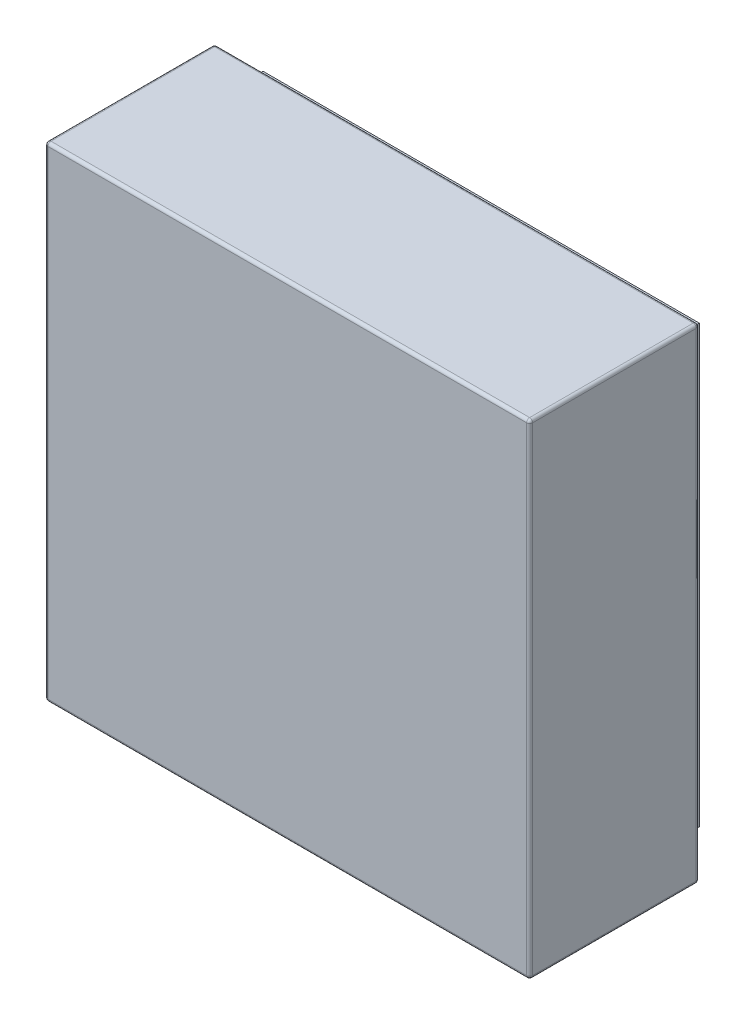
ISO-10303-21;
HEADER;
FILE_DESCRIPTION(('STEP AP214'),'2;1');
FILE_NAME('part.step','',(''),(''),'','','');
FILE_SCHEMA(('AUTOMOTIVE_DESIGN { 1 0 10303 214 1 1 1 1 }'));
ENDSEC;
DATA;
#1=APPLICATION_CONTEXT('core data for automotive mechanical design processes');
#2=APPLICATION_PROTOCOL_DEFINITION('international standard','automotive_design',2000,#1);
#3=PRODUCT_CONTEXT('',#1,'mechanical');
#4=PRODUCT('Part','Part','',(#3));
#5=PRODUCT_RELATED_PRODUCT_CATEGORY('part','',(#4));
#6=PRODUCT_DEFINITION_FORMATION('','',#4);
#7=PRODUCT_DEFINITION_CONTEXT('part definition',#1,'design');
#8=PRODUCT_DEFINITION('design','',#6,#7);
#9=PRODUCT_DEFINITION_SHAPE('','',#8);
#10=(LENGTH_UNIT() NAMED_UNIT(*) SI_UNIT(.MILLI.,.METRE.));
#11=(NAMED_UNIT(*) PLANE_ANGLE_UNIT() SI_UNIT($,.RADIAN.));
#12=(NAMED_UNIT(*) SI_UNIT($,.STERADIAN.) SOLID_ANGLE_UNIT());
#13=UNCERTAINTY_MEASURE_WITH_UNIT(LENGTH_MEASURE(1.E-05),#10,'distance_accuracy_value','');
#14=(GEOMETRIC_REPRESENTATION_CONTEXT(3) GLOBAL_UNCERTAINTY_ASSIGNED_CONTEXT((#13)) GLOBAL_UNIT_ASSIGNED_CONTEXT((#10,
#11,#12)) REPRESENTATION_CONTEXT('',''));
#15=CARTESIAN_POINT('',(0.,0.,0.));
#16=DIRECTION('',(0.,0.,1.));
#17=DIRECTION('',(1.,0.,0.));
#18=AXIS2_PLACEMENT_3D('',#15,#16,#17);
#19=CARTESIAN_POINT('',(0.,8.,0.));
#20=DIRECTION('',(0.,0.,-1.));
#21=DIRECTION('',(-1.,0.,0.));
#22=AXIS2_PLACEMENT_3D('',#19,#20,#21);
#23=PLANE('',#22);
#24=DIRECTION('',(-1.,0.,0.));
#25=VECTOR('',#24,1.);
#26=CARTESIAN_POINT('',(-4.94142135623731,7.6,0.));
#27=LINE('',#26,#25);
#28=CARTESIAN_POINT('',(7.6,7.6,0.));
#29=VERTEX_POINT('',#28);
#30=CARTESIAN_POINT('',(0.400000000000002,7.6,0.));
#31=VERTEX_POINT('',#30);
#32=EDGE_CURVE('E180',#29,#31,#27,.T.);
#33=ORIENTED_EDGE('',*,*,#32,.F.);
#34=DIRECTION('',(0.,-1.,0.));
#35=VECTOR('',#34,1.);
#36=CARTESIAN_POINT('',(7.6,4.,0.));
#37=LINE('',#36,#35);
#38=CARTESIAN_POINT('',(7.6,0.400000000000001,0.));
#39=VERTEX_POINT('',#38);
#40=EDGE_CURVE('E185',#29,#39,#37,.T.);
#41=ORIENTED_EDGE('',*,*,#40,.T.);
#42=DIRECTION('',(-1.,0.,0.));
#43=VECTOR('',#42,1.);
#44=CARTESIAN_POINT('',(-4.94142135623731,0.4,0.));
#45=LINE('',#44,#43);
#46=CARTESIAN_POINT('',(0.399999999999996,0.4,0.));
#47=VERTEX_POINT('',#46);
#48=EDGE_CURVE('E165',#39,#47,#45,.T.);
#49=ORIENTED_EDGE('',*,*,#48,.T.);
#50=DIRECTION('',(0.,-1.,0.));
#51=VECTOR('',#50,1.);
#52=CARTESIAN_POINT('',(0.399999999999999,4.,0.));
#53=LINE('',#52,#51);
#54=EDGE_CURVE('E176',#31,#47,#53,.T.);
#55=ORIENTED_EDGE('',*,*,#54,.F.);
#56=EDGE_LOOP('',(#33,#41,#49,#55));
#57=FACE_BOUND('',#56,.T.);
#58=DIRECTION('',(0.,-1.,0.));
#59=VECTOR('',#58,1.);
#60=CARTESIAN_POINT('',(6.4,6.4,0.));
#61=LINE('',#60,#59);
#62=CARTESIAN_POINT('',(6.4,6.4,0.));
#63=VERTEX_POINT('',#62);
#64=CARTESIAN_POINT('',(6.4,1.6,0.));
#65=VERTEX_POINT('',#64);
#66=EDGE_CURVE('E201',#63,#65,#61,.T.);
#67=ORIENTED_EDGE('',*,*,#66,.F.);
#68=DIRECTION('',(1.,0.,0.));
#69=VECTOR('',#68,1.);
#70=CARTESIAN_POINT('',(6.4,6.4,0.));
#71=LINE('',#70,#69);
#72=CARTESIAN_POINT('',(1.6,6.4,0.));
#73=VERTEX_POINT('',#72);
#74=EDGE_CURVE('E211',#73,#63,#71,.T.);
#75=ORIENTED_EDGE('',*,*,#74,.F.);
#76=DIRECTION('',(0.,1.,0.));
#77=VECTOR('',#76,1.);
#78=CARTESIAN_POINT('',(1.6,6.4,0.));
#79=LINE('',#78,#77);
#80=CARTESIAN_POINT('',(1.6,1.6,0.));
#81=VERTEX_POINT('',#80);
#82=EDGE_CURVE('E208',#81,#73,#79,.T.);
#83=ORIENTED_EDGE('',*,*,#82,.F.);
#84=DIRECTION('',(-1.,0.,0.));
#85=VECTOR('',#84,1.);
#86=CARTESIAN_POINT('',(6.4,1.6,0.));
#87=LINE('',#86,#85);
#88=EDGE_CURVE('E205',#65,#81,#87,.T.);
#89=ORIENTED_EDGE('',*,*,#88,.F.);
#90=EDGE_LOOP('',(#67,#75,#83,#89));
#91=FACE_BOUND('',#90,.T.);
#92=ADVANCED_FACE('F27',(#57,#91),#23,.T.);
#93=CARTESIAN_POINT('',(6.4,6.4,2.1));
#94=DIRECTION('',(1.,0.,0.));
#95=DIRECTION('',(0.,1.,0.));
#96=AXIS2_PLACEMENT_3D('',#93,#94,#95);
#97=PLANE('',#96);
#98=ORIENTED_EDGE('',*,*,#66,.T.);
#99=DIRECTION('',(0.,0.,-1.));
#100=VECTOR('',#99,1.);
#101=CARTESIAN_POINT('',(6.4,1.6,2.1));
#102=LINE('',#101,#100);
#103=CARTESIAN_POINT('',(6.4,1.6,2.1));
#104=VERTEX_POINT('',#103);
#105=EDGE_CURVE('E226',#104,#65,#102,.T.);
#106=ORIENTED_EDGE('',*,*,#105,.F.);
#107=DIRECTION('',(0.,-1.,0.));
#108=VECTOR('',#107,1.);
#109=CARTESIAN_POINT('',(6.4,6.4,2.1));
#110=LINE('',#109,#108);
#111=CARTESIAN_POINT('',(6.4,6.4,2.1));
#112=VERTEX_POINT('',#111);
#113=EDGE_CURVE('E214',#112,#104,#110,.T.);
#114=ORIENTED_EDGE('',*,*,#113,.F.);
#115=DIRECTION('',(0.,0.,-1.));
#116=VECTOR('',#115,1.);
#117=CARTESIAN_POINT('',(6.4,6.4,2.1));
#118=LINE('',#117,#116);
#119=EDGE_CURVE('E227',#112,#63,#118,.T.);
#120=ORIENTED_EDGE('',*,*,#119,.T.);
#121=EDGE_LOOP('',(#98,#106,#114,#120));
#122=FACE_BOUND('',#121,.T.);
#123=ADVANCED_FACE('F386',(#122),#97,.F.);
#124=CARTESIAN_POINT('',(6.4,6.4,2.1));
#125=DIRECTION('',(0.,1.,0.));
#126=DIRECTION('',(0.,0.,1.));
#127=AXIS2_PLACEMENT_3D('',#124,#125,#126);
#128=PLANE('',#127);
#129=ORIENTED_EDGE('',*,*,#74,.T.);
#130=ORIENTED_EDGE('',*,*,#119,.F.);
#131=DIRECTION('',(1.,0.,0.));
#132=VECTOR('',#131,1.);
#133=CARTESIAN_POINT('',(6.4,6.4,2.1));
#134=LINE('',#133,#132);
#135=CARTESIAN_POINT('',(1.6,6.4,2.1));
#136=VERTEX_POINT('',#135);
#137=EDGE_CURVE('E223',#136,#112,#134,.T.);
#138=ORIENTED_EDGE('',*,*,#137,.F.);
#139=DIRECTION('',(0.,0.,-1.));
#140=VECTOR('',#139,1.);
#141=CARTESIAN_POINT('',(1.6,6.4,2.1));
#142=LINE('',#141,#140);
#143=EDGE_CURVE('E230',#136,#73,#142,.T.);
#144=ORIENTED_EDGE('',*,*,#143,.T.);
#145=EDGE_LOOP('',(#129,#130,#138,#144));
#146=FACE_BOUND('',#145,.T.);
#147=ADVANCED_FACE('F393',(#146),#128,.F.);
#148=CARTESIAN_POINT('',(1.6,6.4,2.1));
#149=DIRECTION('',(-1.,0.,0.));
#150=DIRECTION('',(0.,-1.,0.));
#151=AXIS2_PLACEMENT_3D('',#148,#149,#150);
#152=PLANE('',#151);
#153=ORIENTED_EDGE('',*,*,#82,.T.);
#154=ORIENTED_EDGE('',*,*,#143,.F.);
#155=DIRECTION('',(0.,1.,0.));
#156=VECTOR('',#155,1.);
#157=CARTESIAN_POINT('',(1.6,6.4,2.1));
#158=LINE('',#157,#156);
#159=CARTESIAN_POINT('',(1.6,1.6,2.1));
#160=VERTEX_POINT('',#159);
#161=EDGE_CURVE('E220',#160,#136,#158,.T.);
#162=ORIENTED_EDGE('',*,*,#161,.F.);
#163=DIRECTION('',(0.,0.,-1.));
#164=VECTOR('',#163,1.);
#165=CARTESIAN_POINT('',(1.6,1.6,2.1));
#166=LINE('',#165,#164);
#167=EDGE_CURVE('E232',#160,#81,#166,.T.);
#168=ORIENTED_EDGE('',*,*,#167,.T.);
#169=EDGE_LOOP('',(#153,#154,#162,#168));
#170=FACE_BOUND('',#169,.T.);
#171=ADVANCED_FACE('F637',(#170),#152,.F.);
#172=CARTESIAN_POINT('',(6.4,1.6,2.1));
#173=DIRECTION('',(0.,-1.,0.));
#174=DIRECTION('',(0.,0.,-1.));
#175=AXIS2_PLACEMENT_3D('',#172,#173,#174);
#176=PLANE('',#175);
#177=ORIENTED_EDGE('',*,*,#88,.T.);
#178=ORIENTED_EDGE('',*,*,#167,.F.);
#179=DIRECTION('',(-1.,0.,0.));
#180=VECTOR('',#179,1.);
#181=CARTESIAN_POINT('',(6.4,1.6,2.1));
#182=LINE('',#181,#180);
#183=EDGE_CURVE('E217',#104,#160,#182,.T.);
#184=ORIENTED_EDGE('',*,*,#183,.F.);
#185=ORIENTED_EDGE('',*,*,#105,.T.);
#186=EDGE_LOOP('',(#177,#178,#184,#185));
#187=FACE_BOUND('',#186,.T.);
#188=ADVANCED_FACE('F626',(#187),#176,.F.);
#189=CARTESIAN_POINT('',(6.4,1.6,2.1));
#190=DIRECTION('',(0.,0.,-1.));
#191=DIRECTION('',(-1.,0.,0.));
#192=AXIS2_PLACEMENT_3D('',#189,#190,#191);
#193=PLANE('',#192);
#194=CARTESIAN_POINT('',(4.05,4.05,2.1));
#195=DIRECTION('',(0.,0.,-1.));
#196=DIRECTION('',(-1.,0.,0.));
#197=AXIS2_PLACEMENT_3D('',#194,#195,#196);
#198=CIRCLE('',#197,1.1);
#199=CARTESIAN_POINT('',(2.95,4.05,2.1));
#200=VERTEX_POINT('',#199);
#201=EDGE_CURVE('E617',#200,#200,#198,.T.);
#202=ORIENTED_EDGE('',*,*,#201,.F.);
#203=EDGE_LOOP('',(#202));
#204=FACE_BOUND('',#203,.T.);
#205=ORIENTED_EDGE('',*,*,#113,.T.);
#206=ORIENTED_EDGE('',*,*,#183,.T.);
#207=ORIENTED_EDGE('',*,*,#161,.T.);
#208=ORIENTED_EDGE('',*,*,#137,.T.);
#209=EDGE_LOOP('',(#205,#206,#207,#208));
#210=FACE_BOUND('',#209,.T.);
#211=ADVANCED_FACE('F624',(#204,#210),#193,.T.);
#212=CARTESIAN_POINT('',(-4.94142135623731,7.6,0.4));
#213=DIRECTION('',(0.,-1.,0.));
#214=DIRECTION('',(0.,0.,-1.));
#215=AXIS2_PLACEMENT_3D('',#212,#213,#214);
#216=PLANE('',#215);
#217=ORIENTED_EDGE('',*,*,#32,.T.);
#218=DIRECTION('',(0.,0.,-1.));
#219=VECTOR('',#218,1.);
#220=CARTESIAN_POINT('',(0.400000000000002,7.6,0.4));
#221=LINE('',#220,#219);
#222=CARTESIAN_POINT('',(0.400000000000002,7.6,0.4));
#223=VERTEX_POINT('',#222);
#224=EDGE_CURVE('E172',#223,#31,#221,.T.);
#225=ORIENTED_EDGE('',*,*,#224,.F.);
#226=DIRECTION('',(-1.,0.,0.));
#227=VECTOR('',#226,1.);
#228=CARTESIAN_POINT('',(-4.94142135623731,7.6,0.4));
#229=LINE('',#228,#227);
#230=CARTESIAN_POINT('',(7.6,7.6,0.4));
#231=VERTEX_POINT('',#230);
#232=EDGE_CURVE('E187',#231,#223,#229,.T.);
#233=ORIENTED_EDGE('',*,*,#232,.F.);
#234=DIRECTION('',(0.,0.,-1.));
#235=VECTOR('',#234,1.);
#236=CARTESIAN_POINT('',(7.6,7.6,0.4));
#237=LINE('',#236,#235);
#238=EDGE_CURVE('E199',#231,#29,#237,.T.);
#239=ORIENTED_EDGE('',*,*,#238,.T.);
#240=EDGE_LOOP('',(#217,#225,#233,#239));
#241=FACE_BOUND('',#240,.T.);
#242=ADVANCED_FACE('F363',(#241),#216,.F.);
#243=CARTESIAN_POINT('',(7.6,4.,0.4));
#244=DIRECTION('',(1.,0.,0.));
#245=DIRECTION('',(0.,1.,0.));
#246=AXIS2_PLACEMENT_3D('',#243,#244,#245);
#247=PLANE('',#246);
#248=ORIENTED_EDGE('',*,*,#40,.F.);
#249=ORIENTED_EDGE('',*,*,#238,.F.);
#250=DIRECTION('',(0.,-1.,0.));
#251=VECTOR('',#250,1.);
#252=CARTESIAN_POINT('',(7.6,4.,0.4));
#253=LINE('',#252,#251);
#254=CARTESIAN_POINT('',(7.6,0.400000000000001,0.4));
#255=VERTEX_POINT('',#254);
#256=EDGE_CURVE('E196',#231,#255,#253,.T.);
#257=ORIENTED_EDGE('',*,*,#256,.T.);
#258=DIRECTION('',(0.,0.,-1.));
#259=VECTOR('',#258,1.);
#260=CARTESIAN_POINT('',(7.6,0.400000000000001,0.4));
#261=LINE('',#260,#259);
#262=EDGE_CURVE('E171',#255,#39,#261,.T.);
#263=ORIENTED_EDGE('',*,*,#262,.T.);
#264=EDGE_LOOP('',(#248,#249,#257,#263));
#265=FACE_BOUND('',#264,.T.);
#266=ADVANCED_FACE('F367',(#265),#247,.T.);
#267=CARTESIAN_POINT('',(-4.94142135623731,0.4,0.4));
#268=DIRECTION('',(0.,-1.,0.));
#269=DIRECTION('',(0.,0.,-1.));
#270=AXIS2_PLACEMENT_3D('',#267,#268,#269);
#271=PLANE('',#270);
#272=ORIENTED_EDGE('',*,*,#48,.F.);
#273=ORIENTED_EDGE('',*,*,#262,.F.);
#274=DIRECTION('',(-1.,0.,0.));
#275=VECTOR('',#274,1.);
#276=CARTESIAN_POINT('',(-4.94142135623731,0.4,0.4));
#277=LINE('',#276,#275);
#278=CARTESIAN_POINT('',(0.399999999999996,0.4,0.4));
#279=VERTEX_POINT('',#278);
#280=EDGE_CURVE('E167',#255,#279,#277,.T.);
#281=ORIENTED_EDGE('',*,*,#280,.T.);
#282=DIRECTION('',(0.,0.,-1.));
#283=VECTOR('',#282,1.);
#284=CARTESIAN_POINT('',(0.399999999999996,0.4,0.4));
#285=LINE('',#284,#283);
#286=EDGE_CURVE('E160',#279,#47,#285,.T.);
#287=ORIENTED_EDGE('',*,*,#286,.T.);
#288=EDGE_LOOP('',(#272,#273,#281,#287));
#289=FACE_BOUND('',#288,.T.);
#290=ADVANCED_FACE('F162',(#289),#271,.T.);
#291=CARTESIAN_POINT('',(0.399999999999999,4.,0.4));
#292=DIRECTION('',(1.,0.,0.));
#293=DIRECTION('',(0.,1.,0.));
#294=AXIS2_PLACEMENT_3D('',#291,#292,#293);
#295=PLANE('',#294);
#296=ORIENTED_EDGE('',*,*,#54,.T.);
#297=ORIENTED_EDGE('',*,*,#286,.F.);
#298=DIRECTION('',(0.,-1.,0.));
#299=VECTOR('',#298,1.);
#300=CARTESIAN_POINT('',(0.399999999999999,4.,0.4));
#301=LINE('',#300,#299);
#302=EDGE_CURVE('E193',#223,#279,#301,.T.);
#303=ORIENTED_EDGE('',*,*,#302,.F.);
#304=ORIENTED_EDGE('',*,*,#224,.T.);
#305=EDGE_LOOP('',(#296,#297,#303,#304));
#306=FACE_BOUND('',#305,.T.);
#307=ADVANCED_FACE('F177',(#306),#295,.F.);
#308=CARTESIAN_POINT('',(-4.94142135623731,4.,0.4));
#309=DIRECTION('',(0.,0.,-1.));
#310=DIRECTION('',(-1.,0.,0.));
#311=AXIS2_PLACEMENT_3D('',#308,#309,#310);
#312=PLANE('',#311);
#313=DIRECTION('',(0.,-1.,0.));
#314=VECTOR('',#313,1.);
#315=CARTESIAN_POINT('',(0.0500000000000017,8.,0.4));
#316=LINE('',#315,#314);
#317=CARTESIAN_POINT('',(0.05,0.0499999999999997,0.4));
#318=VERTEX_POINT('',#317);
#319=CARTESIAN_POINT('',(0.0500000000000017,7.95,0.4));
#320=VERTEX_POINT('',#319);
#321=EDGE_CURVE('E281',#318,#320,#316,.F.);
#322=ORIENTED_EDGE('',*,*,#321,.T.);
#323=DIRECTION('',(-1.,0.,0.));
#324=VECTOR('',#323,1.);
#325=CARTESIAN_POINT('',(7.95,7.95,0.4));
#326=LINE('',#325,#324);
#327=CARTESIAN_POINT('',(7.95,7.95,0.4));
#328=VERTEX_POINT('',#327);
#329=EDGE_CURVE('E311',#320,#328,#326,.F.);
#330=ORIENTED_EDGE('',*,*,#329,.T.);
#331=DIRECTION('',(0.,1.,0.));
#332=VECTOR('',#331,1.);
#333=CARTESIAN_POINT('',(7.95,0.0499999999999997,0.4));
#334=LINE('',#333,#332);
#335=CARTESIAN_POINT('',(7.95,0.05,0.4));
#336=VERTEX_POINT('',#335);
#337=EDGE_CURVE('E309',#328,#336,#334,.F.);
#338=ORIENTED_EDGE('',*,*,#337,.T.);
#339=DIRECTION('',(1.,0.,0.));
#340=VECTOR('',#339,1.);
#341=CARTESIAN_POINT('',(0.0499999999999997,0.05,0.4));
#342=LINE('',#341,#340);
#343=EDGE_CURVE('E307',#336,#318,#342,.F.);
#344=ORIENTED_EDGE('',*,*,#343,.T.);
#345=EDGE_LOOP('',(#322,#330,#338,#344));
#346=FACE_BOUND('',#345,.T.);
#347=ORIENTED_EDGE('',*,*,#232,.T.);
#348=ORIENTED_EDGE('',*,*,#302,.T.);
#349=ORIENTED_EDGE('',*,*,#280,.F.);
#350=ORIENTED_EDGE('',*,*,#256,.F.);
#351=EDGE_LOOP('',(#347,#348,#349,#350));
#352=FACE_BOUND('',#351,.T.);
#353=ADVANCED_FACE('F369',(#346,#352),#312,.T.);
#354=CARTESIAN_POINT('',(0.,8.,3.2));
#355=DIRECTION('',(0.,0.,-1.));
#356=DIRECTION('',(-1.,0.,0.));
#357=AXIS2_PLACEMENT_3D('',#354,#355,#356);
#358=PLANE('',#357);
#359=DIRECTION('',(0.,1.,0.));
#360=VECTOR('',#359,1.);
#361=CARTESIAN_POINT('',(7.95,8.,3.2));
#362=LINE('',#361,#360);
#363=CARTESIAN_POINT('',(7.95,0.0499999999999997,3.2));
#364=VERTEX_POINT('',#363);
#365=CARTESIAN_POINT('',(7.95,7.95,3.2));
#366=VERTEX_POINT('',#365);
#367=EDGE_CURVE('E241',#364,#366,#362,.T.);
#368=ORIENTED_EDGE('',*,*,#367,.T.);
#369=DIRECTION('',(-1.,0.,0.));
#370=VECTOR('',#369,1.);
#371=CARTESIAN_POINT('',(0.,7.95,3.2));
#372=LINE('',#371,#370);
#373=CARTESIAN_POINT('',(0.0500000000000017,7.95,3.2));
#374=VERTEX_POINT('',#373);
#375=EDGE_CURVE('E244',#366,#374,#372,.T.);
#376=ORIENTED_EDGE('',*,*,#375,.T.);
#377=DIRECTION('',(0.,-1.,0.));
#378=VECTOR('',#377,1.);
#379=CARTESIAN_POINT('',(0.0500000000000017,8.,3.2));
#380=LINE('',#379,#378);
#381=CARTESIAN_POINT('',(0.05,0.0499999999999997,3.2));
#382=VERTEX_POINT('',#381);
#383=EDGE_CURVE('E229',#374,#382,#380,.T.);
#384=ORIENTED_EDGE('',*,*,#383,.T.);
#385=DIRECTION('',(1.,0.,0.));
#386=VECTOR('',#385,1.);
#387=CARTESIAN_POINT('',(0.,0.0499999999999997,3.2));
#388=LINE('',#387,#386);
#389=EDGE_CURVE('E238',#382,#364,#388,.T.);
#390=ORIENTED_EDGE('',*,*,#389,.T.);
#391=EDGE_LOOP('',(#368,#376,#384,#390));
#392=FACE_BOUND('',#391,.T.);
#393=ADVANCED_FACE('F371',(#392),#358,.F.);
#394=CARTESIAN_POINT('',(0.,8.,3.2));
#395=DIRECTION('',(0.,-1.,0.));
#396=DIRECTION('',(0.,0.,-1.));
#397=AXIS2_PLACEMENT_3D('',#394,#395,#396);
#398=PLANE('',#397);
#399=DIRECTION('',(0.,0.,-1.));
#400=VECTOR('',#399,1.);
#401=CARTESIAN_POINT('',(7.95,8.,3.2));
#402=LINE('',#401,#400);
#403=CARTESIAN_POINT('',(7.95,8.,3.15));
#404=VERTEX_POINT('',#403);
#405=CARTESIAN_POINT('',(7.95,8.,0.45));
#406=VERTEX_POINT('',#405);
#407=EDGE_CURVE('E289',#404,#406,#402,.T.);
#408=ORIENTED_EDGE('',*,*,#407,.T.);
#409=DIRECTION('',(-1.,0.,0.));
#410=VECTOR('',#409,1.);
#411=CARTESIAN_POINT('',(0.0500000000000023,8.,0.45));
#412=LINE('',#411,#410);
#413=CARTESIAN_POINT('',(0.0500000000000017,8.,0.45));
#414=VERTEX_POINT('',#413);
#415=EDGE_CURVE('E305',#406,#414,#412,.T.);
#416=ORIENTED_EDGE('',*,*,#415,.T.);
#417=DIRECTION('',(0.,0.,-1.));
#418=VECTOR('',#417,1.);
#419=CARTESIAN_POINT('',(0.0500000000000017,8.,3.2));
#420=LINE('',#419,#418);
#421=CARTESIAN_POINT('',(0.0500000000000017,8.,3.15));
#422=VERTEX_POINT('',#421);
#423=EDGE_CURVE('E292',#414,#422,#420,.F.);
#424=ORIENTED_EDGE('',*,*,#423,.T.);
#425=DIRECTION('',(-1.,0.,0.));
#426=VECTOR('',#425,1.);
#427=CARTESIAN_POINT('',(0.,8.,3.15));
#428=LINE('',#427,#426);
#429=EDGE_CURVE('E247',#422,#404,#428,.F.);
#430=ORIENTED_EDGE('',*,*,#429,.T.);
#431=EDGE_LOOP('',(#408,#416,#424,#430));
#432=FACE_BOUND('',#431,.T.);
#433=ADVANCED_FACE('F378',(#432),#398,.F.);
#434=CARTESIAN_POINT('',(8.,0.,3.2));
#435=DIRECTION('',(-1.,0.,0.));
#436=DIRECTION('',(0.,0.,1.));
#437=AXIS2_PLACEMENT_3D('',#434,#435,#436);
#438=PLANE('',#437);
#439=DIRECTION('',(0.,0.,-1.));
#440=VECTOR('',#439,1.);
#441=CARTESIAN_POINT('',(8.,0.05,3.2));
#442=LINE('',#441,#440);
#443=CARTESIAN_POINT('',(8.,0.05,3.15));
#444=VERTEX_POINT('',#443);
#445=CARTESIAN_POINT('',(8.,0.05,0.45));
#446=VERTEX_POINT('',#445);
#447=EDGE_CURVE('E286',#444,#446,#442,.T.);
#448=ORIENTED_EDGE('',*,*,#447,.T.);
#449=DIRECTION('',(0.,1.,0.));
#450=VECTOR('',#449,1.);
#451=CARTESIAN_POINT('',(8.,7.95,0.45));
#452=LINE('',#451,#450);
#453=CARTESIAN_POINT('',(8.,7.95,0.45));
#454=VERTEX_POINT('',#453);
#455=EDGE_CURVE('E315',#446,#454,#452,.T.);
#456=ORIENTED_EDGE('',*,*,#455,.T.);
#457=DIRECTION('',(0.,0.,-1.));
#458=VECTOR('',#457,1.);
#459=CARTESIAN_POINT('',(8.,7.95,3.2));
#460=LINE('',#459,#458);
#461=CARTESIAN_POINT('',(8.,7.95,3.15));
#462=VERTEX_POINT('',#461);
#463=EDGE_CURVE('E284',#454,#462,#460,.F.);
#464=ORIENTED_EDGE('',*,*,#463,.T.);
#465=DIRECTION('',(0.,1.,0.));
#466=VECTOR('',#465,1.);
#467=CARTESIAN_POINT('',(8.,0.,3.15));
#468=LINE('',#467,#466);
#469=EDGE_CURVE('E250',#462,#444,#468,.F.);
#470=ORIENTED_EDGE('',*,*,#469,.T.);
#471=EDGE_LOOP('',(#448,#456,#464,#470));
#472=FACE_BOUND('',#471,.T.);
#473=ADVANCED_FACE('F330',(#472),#438,.F.);
#474=CARTESIAN_POINT('',(0.,0.,3.2));
#475=DIRECTION('',(0.,1.,0.));
#476=DIRECTION('',(0.,0.,1.));
#477=AXIS2_PLACEMENT_3D('',#474,#475,#476);
#478=PLANE('',#477);
#479=DIRECTION('',(0.,0.,-1.));
#480=VECTOR('',#479,1.);
#481=CARTESIAN_POINT('',(0.05,0.,3.2));
#482=LINE('',#481,#480);
#483=CARTESIAN_POINT('',(0.05,0.,3.15));
#484=VERTEX_POINT('',#483);
#485=CARTESIAN_POINT('',(0.05,0.,0.45));
#486=VERTEX_POINT('',#485);
#487=EDGE_CURVE('E42',#484,#486,#482,.T.);
#488=ORIENTED_EDGE('',*,*,#487,.T.);
#489=DIRECTION('',(1.,0.,0.));
#490=VECTOR('',#489,1.);
#491=CARTESIAN_POINT('',(7.95,0.,0.45));
#492=LINE('',#491,#490);
#493=CARTESIAN_POINT('',(7.95,0.,0.45));
#494=VERTEX_POINT('',#493);
#495=EDGE_CURVE('E35',#486,#494,#492,.T.);
#496=ORIENTED_EDGE('',*,*,#495,.T.);
#497=DIRECTION('',(0.,0.,-1.));
#498=VECTOR('',#497,1.);
#499=CARTESIAN_POINT('',(7.95,0.,3.2));
#500=LINE('',#499,#498);
#501=CARTESIAN_POINT('',(7.95,0.,3.15));
#502=VERTEX_POINT('',#501);
#503=EDGE_CURVE('E279',#494,#502,#500,.F.);
#504=ORIENTED_EDGE('',*,*,#503,.T.);
#505=DIRECTION('',(1.,0.,0.));
#506=VECTOR('',#505,1.);
#507=CARTESIAN_POINT('',(0.,0.,3.15));
#508=LINE('',#507,#506);
#509=EDGE_CURVE('E253',#502,#484,#508,.F.);
#510=ORIENTED_EDGE('',*,*,#509,.T.);
#511=EDGE_LOOP('',(#488,#496,#504,#510));
#512=FACE_BOUND('',#511,.T.);
#513=ADVANCED_FACE('F402',(#512),#478,.F.);
#514=CARTESIAN_POINT('',(0.,0.,3.2));
#515=DIRECTION('',(1.,0.,0.));
#516=DIRECTION('',(0.,1.,0.));
#517=AXIS2_PLACEMENT_3D('',#514,#515,#516);
#518=PLANE('',#517);
#519=DIRECTION('',(0.,-1.,0.));
#520=VECTOR('',#519,1.);
#521=CARTESIAN_POINT('',(0.,0.,0.45));
#522=LINE('',#521,#520);
#523=CARTESIAN_POINT('',(0.,7.95,0.45));
#524=VERTEX_POINT('',#523);
#525=CARTESIAN_POINT('',(0.,0.05,0.45));
#526=VERTEX_POINT('',#525);
#527=EDGE_CURVE('E276',#524,#526,#522,.T.);
#528=ORIENTED_EDGE('',*,*,#527,.T.);
#529=DIRECTION('',(0.,0.,-1.));
#530=VECTOR('',#529,1.);
#531=CARTESIAN_POINT('',(0.,0.05,3.2));
#532=LINE('',#531,#530);
#533=CARTESIAN_POINT('',(0.,0.05,3.15));
#534=VERTEX_POINT('',#533);
#535=EDGE_CURVE('E11',#526,#534,#532,.F.);
#536=ORIENTED_EDGE('',*,*,#535,.T.);
#537=DIRECTION('',(0.,-1.,0.));
#538=VECTOR('',#537,1.);
#539=CARTESIAN_POINT('',(0.,0.,3.15));
#540=LINE('',#539,#538);
#541=CARTESIAN_POINT('',(0.,7.95,3.15));
#542=VERTEX_POINT('',#541);
#543=EDGE_CURVE('E255',#534,#542,#540,.F.);
#544=ORIENTED_EDGE('',*,*,#543,.T.);
#545=DIRECTION('',(0.,0.,-1.));
#546=VECTOR('',#545,1.);
#547=CARTESIAN_POINT('',(0.,7.95,3.2));
#548=LINE('',#547,#546);
#549=EDGE_CURVE('E273',#542,#524,#548,.T.);
#550=ORIENTED_EDGE('',*,*,#549,.T.);
#551=EDGE_LOOP('',(#528,#536,#544,#550));
#552=FACE_BOUND('',#551,.T.);
#553=ADVANCED_FACE('F29',(#552),#518,.F.);
#554=CARTESIAN_POINT('',(0.,0.0499999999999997,3.15));
#555=DIRECTION('',(1.,0.,0.));
#556=DIRECTION('',(0.,0.,-1.));
#557=AXIS2_PLACEMENT_3D('',#554,#555,#556);
#558=CYLINDRICAL_SURFACE('',#557,0.05);
#559=ORIENTED_EDGE('',*,*,#389,.F.);
#560=CARTESIAN_POINT('',(0.05,0.0499999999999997,3.15));
#561=DIRECTION('',(1.,0.,0.));
#562=DIRECTION('',(0.,0.,-1.));
#563=AXIS2_PLACEMENT_3D('',#560,#561,#562);
#564=CIRCLE('',#563,0.05);
#565=EDGE_CURVE('E297',#382,#484,#564,.T.);
#566=ORIENTED_EDGE('',*,*,#565,.T.);
#567=ORIENTED_EDGE('',*,*,#509,.F.);
#568=CARTESIAN_POINT('',(7.95,0.0499999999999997,3.15));
#569=DIRECTION('',(1.,0.,0.));
#570=DIRECTION('',(0.,0.,-1.));
#571=AXIS2_PLACEMENT_3D('',#568,#569,#570);
#572=CIRCLE('',#571,0.05);
#573=EDGE_CURVE('E262',#502,#364,#572,.F.);
#574=ORIENTED_EDGE('',*,*,#573,.T.);
#575=EDGE_LOOP('',(#559,#566,#567,#574));
#576=FACE_BOUND('',#575,.T.);
#577=ADVANCED_FACE('F407',(#576),#558,.T.);
#578=CARTESIAN_POINT('',(7.95,8.,3.15));
#579=DIRECTION('',(0.,1.,0.));
#580=DIRECTION('',(0.,0.,1.));
#581=AXIS2_PLACEMENT_3D('',#578,#579,#580);
#582=CYLINDRICAL_SURFACE('',#581,0.05);
#583=ORIENTED_EDGE('',*,*,#367,.F.);
#584=CARTESIAN_POINT('',(7.95,0.0499999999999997,3.15));
#585=DIRECTION('',(0.,1.,0.));
#586=DIRECTION('',(0.,0.,1.));
#587=AXIS2_PLACEMENT_3D('',#584,#585,#586);
#588=CIRCLE('',#587,0.05);
#589=EDGE_CURVE('E259',#364,#444,#588,.T.);
#590=ORIENTED_EDGE('',*,*,#589,.T.);
#591=ORIENTED_EDGE('',*,*,#469,.F.);
#592=CARTESIAN_POINT('',(7.95,7.95,3.15));
#593=DIRECTION('',(0.,1.,0.));
#594=DIRECTION('',(0.,0.,1.));
#595=AXIS2_PLACEMENT_3D('',#592,#593,#594);
#596=CIRCLE('',#595,0.05);
#597=EDGE_CURVE('E257',#462,#366,#596,.F.);
#598=ORIENTED_EDGE('',*,*,#597,.T.);
#599=EDGE_LOOP('',(#583,#590,#591,#598));
#600=FACE_BOUND('',#599,.T.);
#601=ADVANCED_FACE('F412',(#600),#582,.T.);
#602=CARTESIAN_POINT('',(0.0500000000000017,8.,3.15));
#603=DIRECTION('',(0.,-1.,0.));
#604=DIRECTION('',(1.,0.,0.));
#605=AXIS2_PLACEMENT_3D('',#602,#603,#604);
#606=CYLINDRICAL_SURFACE('',#605,0.05);
#607=ORIENTED_EDGE('',*,*,#543,.F.);
#608=CARTESIAN_POINT('',(0.05,0.0499999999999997,3.15));
#609=DIRECTION('',(0.,-1.,0.));
#610=DIRECTION('',(1.,0.,0.));
#611=AXIS2_PLACEMENT_3D('',#608,#609,#610);
#612=CIRCLE('',#611,0.05);
#613=EDGE_CURVE('E294',#534,#382,#612,.F.);
#614=ORIENTED_EDGE('',*,*,#613,.T.);
#615=ORIENTED_EDGE('',*,*,#383,.F.);
#616=CARTESIAN_POINT('',(0.0500000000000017,7.95,3.15));
#617=DIRECTION('',(0.,-1.,0.));
#618=DIRECTION('',(1.,0.,0.));
#619=AXIS2_PLACEMENT_3D('',#616,#617,#618);
#620=CIRCLE('',#619,0.05);
#621=EDGE_CURVE('E270',#374,#542,#620,.T.);
#622=ORIENTED_EDGE('',*,*,#621,.T.);
#623=EDGE_LOOP('',(#607,#614,#615,#622));
#624=FACE_BOUND('',#623,.T.);
#625=ADVANCED_FACE('F441',(#624),#606,.T.);
#626=CARTESIAN_POINT('',(0.,7.95,3.15));
#627=DIRECTION('',(-1.,0.,0.));
#628=DIRECTION('',(0.,0.,1.));
#629=AXIS2_PLACEMENT_3D('',#626,#627,#628);
#630=CYLINDRICAL_SURFACE('',#629,0.05);
#631=ORIENTED_EDGE('',*,*,#429,.F.);
#632=CARTESIAN_POINT('',(0.0500000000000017,7.95,3.15));
#633=DIRECTION('',(-1.,0.,0.));
#634=DIRECTION('',(0.,0.,1.));
#635=AXIS2_PLACEMENT_3D('',#632,#633,#634);
#636=CIRCLE('',#635,0.05);
#637=EDGE_CURVE('E267',#422,#374,#636,.F.);
#638=ORIENTED_EDGE('',*,*,#637,.T.);
#639=ORIENTED_EDGE('',*,*,#375,.F.);
#640=CARTESIAN_POINT('',(7.95,7.95,3.15));
#641=DIRECTION('',(-1.,0.,0.));
#642=DIRECTION('',(0.,0.,1.));
#643=AXIS2_PLACEMENT_3D('',#640,#641,#642);
#644=CIRCLE('',#643,0.05);
#645=EDGE_CURVE('E264',#366,#404,#644,.T.);
#646=ORIENTED_EDGE('',*,*,#645,.T.);
#647=EDGE_LOOP('',(#631,#638,#639,#646));
#648=FACE_BOUND('',#647,.T.);
#649=ADVANCED_FACE('F455',(#648),#630,.T.);
#650=CARTESIAN_POINT('',(7.95,0.05,3.2));
#651=DIRECTION('',(0.,0.,-1.));
#652=DIRECTION('',(-1.,0.,0.));
#653=AXIS2_PLACEMENT_3D('',#650,#651,#652);
#654=CYLINDRICAL_SURFACE('',#653,0.05);
#655=ORIENTED_EDGE('',*,*,#503,.F.);
#656=CARTESIAN_POINT('',(7.95,0.05,0.45));
#657=DIRECTION('',(0.,0.,-1.));
#658=DIRECTION('',(-1.,0.,0.));
#659=AXIS2_PLACEMENT_3D('',#656,#657,#658);
#660=CIRCLE('',#659,0.05);
#661=EDGE_CURVE('E317',#494,#446,#660,.F.);
#662=ORIENTED_EDGE('',*,*,#661,.T.);
#663=ORIENTED_EDGE('',*,*,#447,.F.);
#664=CARTESIAN_POINT('',(7.95,0.05,3.15));
#665=DIRECTION('',(0.,0.,1.));
#666=DIRECTION('',(1.,0.,0.));
#667=AXIS2_PLACEMENT_3D('',#664,#665,#666);
#668=CIRCLE('',#667,0.05);
#669=EDGE_CURVE('E361',#502,#444,#668,.T.);
#670=ORIENTED_EDGE('',*,*,#669,.F.);
#671=EDGE_LOOP('',(#655,#662,#663,#670));
#672=FACE_BOUND('',#671,.T.);
#673=ADVANCED_FACE('F322',(#672),#654,.T.);
#674=CARTESIAN_POINT('',(7.95,0.0499999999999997,3.15));
#675=DIRECTION('',(0.,0.,1.));
#676=DIRECTION('',(1.,0.,0.));
#677=AXIS2_PLACEMENT_3D('',#674,#675,#676);
#678=SPHERICAL_SURFACE('',#677,0.05);
#679=ORIENTED_EDGE('',*,*,#589,.F.);
#680=ORIENTED_EDGE('',*,*,#573,.F.);
#681=ORIENTED_EDGE('',*,*,#669,.T.);
#682=EDGE_LOOP('',(#679,#680,#681));
#683=FACE_BOUND('',#682,.T.);
#684=ADVANCED_FACE('F449',(#683),#678,.T.);
#685=CARTESIAN_POINT('',(0.05,0.,0.45));
#686=DIRECTION('',(0.,1.,0.));
#687=DIRECTION('',(-1.,0.,0.));
#688=AXIS2_PLACEMENT_3D('',#685,#686,#687);
#689=CYLINDRICAL_SURFACE('',#688,0.05);
#690=ORIENTED_EDGE('',*,*,#527,.F.);
#691=CARTESIAN_POINT('',(0.0500000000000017,7.95,0.45));
#692=DIRECTION('',(0.,1.,0.));
#693=DIRECTION('',(-1.,0.,0.));
#694=AXIS2_PLACEMENT_3D('',#691,#692,#693);
#695=CIRCLE('',#694,0.05);
#696=EDGE_CURVE('E303',#524,#320,#695,.F.);
#697=ORIENTED_EDGE('',*,*,#696,.T.);
#698=ORIENTED_EDGE('',*,*,#321,.F.);
#699=CARTESIAN_POINT('',(0.05,0.05,0.45));
#700=DIRECTION('',(0.,1.,0.));
#701=DIRECTION('',(-1.,0.,0.));
#702=AXIS2_PLACEMENT_3D('',#699,#700,#701);
#703=CIRCLE('',#702,0.05);
#704=EDGE_CURVE('E301',#318,#526,#703,.T.);
#705=ORIENTED_EDGE('',*,*,#704,.T.);
#706=EDGE_LOOP('',(#690,#697,#698,#705));
#707=FACE_BOUND('',#706,.T.);
#708=ADVANCED_FACE('F490',(#707),#689,.T.);
#709=CARTESIAN_POINT('',(0.0500000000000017,7.95,3.2));
#710=DIRECTION('',(0.,0.,-1.));
#711=DIRECTION('',(-1.,0.,0.));
#712=AXIS2_PLACEMENT_3D('',#709,#710,#711);
#713=CYLINDRICAL_SURFACE('',#712,0.05);
#714=ORIENTED_EDGE('',*,*,#423,.F.);
#715=CARTESIAN_POINT('',(0.0500000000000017,7.95,0.45));
#716=DIRECTION('',(0.,0.,-1.));
#717=DIRECTION('',(-1.,0.,0.));
#718=AXIS2_PLACEMENT_3D('',#715,#716,#717);
#719=CIRCLE('',#718,0.05);
#720=EDGE_CURVE('E299',#414,#524,#719,.F.);
#721=ORIENTED_EDGE('',*,*,#720,.T.);
#722=ORIENTED_EDGE('',*,*,#549,.F.);
#723=CARTESIAN_POINT('',(0.0500000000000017,7.95,3.15));
#724=DIRECTION('',(0.,0.,1.));
#725=DIRECTION('',(1.,0.,0.));
#726=AXIS2_PLACEMENT_3D('',#723,#724,#725);
#727=CIRCLE('',#726,0.05);
#728=EDGE_CURVE('E358',#422,#542,#727,.T.);
#729=ORIENTED_EDGE('',*,*,#728,.F.);
#730=EDGE_LOOP('',(#714,#721,#722,#729));
#731=FACE_BOUND('',#730,.T.);
#732=ADVANCED_FACE('F478',(#731),#713,.T.);
#733=CARTESIAN_POINT('',(0.0500000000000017,7.95,3.15));
#734=DIRECTION('',(0.,0.,1.));
#735=DIRECTION('',(1.,0.,0.));
#736=AXIS2_PLACEMENT_3D('',#733,#734,#735);
#737=SPHERICAL_SURFACE('',#736,0.05);
#738=ORIENTED_EDGE('',*,*,#728,.T.);
#739=ORIENTED_EDGE('',*,*,#621,.F.);
#740=ORIENTED_EDGE('',*,*,#637,.F.);
#741=EDGE_LOOP('',(#738,#739,#740));
#742=FACE_BOUND('',#741,.T.);
#743=ADVANCED_FACE('F481',(#742),#737,.T.);
#744=CARTESIAN_POINT('',(7.95,7.95,3.2));
#745=DIRECTION('',(0.,0.,-1.));
#746=DIRECTION('',(-1.,0.,0.));
#747=AXIS2_PLACEMENT_3D('',#744,#745,#746);
#748=CYLINDRICAL_SURFACE('',#747,0.05);
#749=ORIENTED_EDGE('',*,*,#463,.F.);
#750=CARTESIAN_POINT('',(7.95,7.95,0.45));
#751=DIRECTION('',(0.,0.,-1.));
#752=DIRECTION('',(-1.,0.,0.));
#753=AXIS2_PLACEMENT_3D('',#750,#751,#752);
#754=CIRCLE('',#753,0.05);
#755=EDGE_CURVE('E313',#454,#406,#754,.F.);
#756=ORIENTED_EDGE('',*,*,#755,.T.);
#757=ORIENTED_EDGE('',*,*,#407,.F.);
#758=CARTESIAN_POINT('',(7.95,7.95,3.15));
#759=DIRECTION('',(0.,0.,1.));
#760=DIRECTION('',(1.,0.,0.));
#761=AXIS2_PLACEMENT_3D('',#758,#759,#760);
#762=CIRCLE('',#761,0.05);
#763=EDGE_CURVE('E356',#462,#404,#762,.T.);
#764=ORIENTED_EDGE('',*,*,#763,.F.);
#765=EDGE_LOOP('',(#749,#756,#757,#764));
#766=FACE_BOUND('',#765,.T.);
#767=ADVANCED_FACE('F462',(#766),#748,.T.);
#768=CARTESIAN_POINT('',(7.95,7.95,3.15));
#769=DIRECTION('',(0.,0.,1.));
#770=DIRECTION('',(1.,0.,0.));
#771=AXIS2_PLACEMENT_3D('',#768,#769,#770);
#772=SPHERICAL_SURFACE('',#771,0.05);
#773=ORIENTED_EDGE('',*,*,#645,.F.);
#774=ORIENTED_EDGE('',*,*,#597,.F.);
#775=ORIENTED_EDGE('',*,*,#763,.T.);
#776=EDGE_LOOP('',(#773,#774,#775));
#777=FACE_BOUND('',#776,.T.);
#778=ADVANCED_FACE('F458',(#777),#772,.T.);
#779=CARTESIAN_POINT('',(0.0500000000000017,7.95,0.45));
#780=DIRECTION('',(0.,0.,1.));
#781=DIRECTION('',(1.,0.,0.));
#782=AXIS2_PLACEMENT_3D('',#779,#780,#781);
#783=SPHERICAL_SURFACE('',#782,0.05);
#784=ORIENTED_EDGE('',*,*,#696,.F.);
#785=ORIENTED_EDGE('',*,*,#720,.F.);
#786=CARTESIAN_POINT('',(0.0500000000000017,7.95,0.45));
#787=DIRECTION('',(1.,0.,0.));
#788=DIRECTION('',(0.,0.,-1.));
#789=AXIS2_PLACEMENT_3D('',#786,#787,#788);
#790=CIRCLE('',#789,0.05);
#791=EDGE_CURVE('E353',#320,#414,#790,.T.);
#792=ORIENTED_EDGE('',*,*,#791,.F.);
#793=EDGE_LOOP('',(#784,#785,#792));
#794=FACE_BOUND('',#793,.T.);
#795=ADVANCED_FACE('F476',(#794),#783,.T.);
#796=CARTESIAN_POINT('',(0.,7.95,0.45));
#797=DIRECTION('',(1.,0.,0.));
#798=DIRECTION('',(0.,0.,-1.));
#799=AXIS2_PLACEMENT_3D('',#796,#797,#798);
#800=CYLINDRICAL_SURFACE('',#799,0.05);
#801=ORIENTED_EDGE('',*,*,#791,.T.);
#802=ORIENTED_EDGE('',*,*,#415,.F.);
#803=CARTESIAN_POINT('',(7.95,7.95,0.45));
#804=DIRECTION('',(1.,0.,0.));
#805=DIRECTION('',(0.,0.,-1.));
#806=AXIS2_PLACEMENT_3D('',#803,#804,#805);
#807=CIRCLE('',#806,0.05);
#808=EDGE_CURVE('E345',#328,#406,#807,.T.);
#809=ORIENTED_EDGE('',*,*,#808,.F.);
#810=ORIENTED_EDGE('',*,*,#329,.F.);
#811=EDGE_LOOP('',(#801,#802,#809,#810));
#812=FACE_BOUND('',#811,.T.);
#813=ADVANCED_FACE('F468',(#812),#800,.T.);
#814=CARTESIAN_POINT('',(7.95,7.95,0.45));
#815=DIRECTION('',(0.,0.,1.));
#816=DIRECTION('',(1.,0.,0.));
#817=AXIS2_PLACEMENT_3D('',#814,#815,#816);
#818=SPHERICAL_SURFACE('',#817,0.05);
#819=ORIENTED_EDGE('',*,*,#808,.T.);
#820=ORIENTED_EDGE('',*,*,#755,.F.);
#821=CARTESIAN_POINT('',(7.95,7.95,0.45));
#822=DIRECTION('',(0.,-1.,0.));
#823=DIRECTION('',(0.,0.,-1.));
#824=AXIS2_PLACEMENT_3D('',#821,#822,#823);
#825=CIRCLE('',#824,0.05);
#826=EDGE_CURVE('E340',#328,#454,#825,.T.);
#827=ORIENTED_EDGE('',*,*,#826,.F.);
#828=EDGE_LOOP('',(#819,#820,#827));
#829=FACE_BOUND('',#828,.T.);
#830=ADVANCED_FACE('F472',(#829),#818,.T.);
#831=CARTESIAN_POINT('',(7.95,0.,0.45));
#832=DIRECTION('',(0.,-1.,0.));
#833=DIRECTION('',(0.,0.,-1.));
#834=AXIS2_PLACEMENT_3D('',#831,#832,#833);
#835=CYLINDRICAL_SURFACE('',#834,0.05);
#836=ORIENTED_EDGE('',*,*,#826,.T.);
#837=ORIENTED_EDGE('',*,*,#455,.F.);
#838=CARTESIAN_POINT('',(7.95,0.05,0.45));
#839=DIRECTION('',(0.,-1.,0.));
#840=DIRECTION('',(0.,0.,-1.));
#841=AXIS2_PLACEMENT_3D('',#838,#839,#840);
#842=CIRCLE('',#841,0.05);
#843=EDGE_CURVE('E338',#336,#446,#842,.T.);
#844=ORIENTED_EDGE('',*,*,#843,.F.);
#845=ORIENTED_EDGE('',*,*,#337,.F.);
#846=EDGE_LOOP('',(#836,#837,#844,#845));
#847=FACE_BOUND('',#846,.T.);
#848=ADVANCED_FACE('F336',(#847),#835,.T.);
#849=CARTESIAN_POINT('',(7.95,0.05,0.45));
#850=DIRECTION('',(0.,0.,1.));
#851=DIRECTION('',(1.,0.,0.));
#852=AXIS2_PLACEMENT_3D('',#849,#850,#851);
#853=SPHERICAL_SURFACE('',#852,0.05);
#854=ORIENTED_EDGE('',*,*,#843,.T.);
#855=ORIENTED_EDGE('',*,*,#661,.F.);
#856=CARTESIAN_POINT('',(7.95,0.05,0.45));
#857=DIRECTION('',(-1.,0.,0.));
#858=DIRECTION('',(0.,0.,1.));
#859=AXIS2_PLACEMENT_3D('',#856,#857,#858);
#860=CIRCLE('',#859,0.05);
#861=EDGE_CURVE('E342',#336,#494,#860,.T.);
#862=ORIENTED_EDGE('',*,*,#861,.F.);
#863=EDGE_LOOP('',(#854,#855,#862));
#864=FACE_BOUND('',#863,.T.);
#865=ADVANCED_FACE('F341',(#864),#853,.T.);
#866=CARTESIAN_POINT('',(0.,0.05,0.45));
#867=DIRECTION('',(-1.,0.,0.));
#868=DIRECTION('',(0.,0.,1.));
#869=AXIS2_PLACEMENT_3D('',#866,#867,#868);
#870=CYLINDRICAL_SURFACE('',#869,0.05);
#871=CARTESIAN_POINT('',(0.05,0.05,0.45));
#872=DIRECTION('',(-1.,0.,0.));
#873=DIRECTION('',(0.,0.,1.));
#874=AXIS2_PLACEMENT_3D('',#871,#872,#873);
#875=CIRCLE('',#874,0.05);
#876=EDGE_CURVE('E347',#318,#486,#875,.T.);
#877=ORIENTED_EDGE('',*,*,#876,.F.);
#878=ORIENTED_EDGE('',*,*,#343,.F.);
#879=ORIENTED_EDGE('',*,*,#861,.T.);
#880=ORIENTED_EDGE('',*,*,#495,.F.);
#881=EDGE_LOOP('',(#877,#878,#879,#880));
#882=FACE_BOUND('',#881,.T.);
#883=ADVANCED_FACE('F571',(#882),#870,.T.);
#884=CARTESIAN_POINT('',(0.05,0.05,0.45));
#885=DIRECTION('',(0.,0.,1.));
#886=DIRECTION('',(1.,0.,0.));
#887=AXIS2_PLACEMENT_3D('',#884,#885,#886);
#888=SPHERICAL_SURFACE('',#887,0.05);
#889=ORIENTED_EDGE('',*,*,#704,.F.);
#890=ORIENTED_EDGE('',*,*,#876,.T.);
#891=CARTESIAN_POINT('',(0.05,0.05,0.45));
#892=DIRECTION('',(0.,0.,1.));
#893=DIRECTION('',(1.,0.,0.));
#894=AXIS2_PLACEMENT_3D('',#891,#892,#893);
#895=CIRCLE('',#894,0.05);
#896=EDGE_CURVE('E425',#526,#486,#895,.T.);
#897=ORIENTED_EDGE('',*,*,#896,.F.);
#898=EDGE_LOOP('',(#889,#890,#897));
#899=FACE_BOUND('',#898,.T.);
#900=ADVANCED_FACE('F426',(#899),#888,.T.);
#901=CARTESIAN_POINT('',(0.05,0.05,3.2));
#902=DIRECTION('',(0.,0.,-1.));
#903=DIRECTION('',(-1.,0.,0.));
#904=AXIS2_PLACEMENT_3D('',#901,#902,#903);
#905=CYLINDRICAL_SURFACE('',#904,0.05);
#906=ORIENTED_EDGE('',*,*,#896,.T.);
#907=ORIENTED_EDGE('',*,*,#487,.F.);
#908=CARTESIAN_POINT('',(0.05,0.05,3.15));
#909=DIRECTION('',(0.,0.,1.));
#910=DIRECTION('',(1.,0.,0.));
#911=AXIS2_PLACEMENT_3D('',#908,#909,#910);
#912=CIRCLE('',#911,0.05);
#913=EDGE_CURVE('E429',#534,#484,#912,.T.);
#914=ORIENTED_EDGE('',*,*,#913,.F.);
#915=ORIENTED_EDGE('',*,*,#535,.F.);
#916=EDGE_LOOP('',(#906,#907,#914,#915));
#917=FACE_BOUND('',#916,.T.);
#918=ADVANCED_FACE('F432',(#917),#905,.T.);
#919=CARTESIAN_POINT('',(0.05,0.0499999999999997,3.15));
#920=DIRECTION('',(0.,0.,1.));
#921=DIRECTION('',(1.,0.,0.));
#922=AXIS2_PLACEMENT_3D('',#919,#920,#921);
#923=SPHERICAL_SURFACE('',#922,0.05);
#924=ORIENTED_EDGE('',*,*,#913,.T.);
#925=ORIENTED_EDGE('',*,*,#565,.F.);
#926=ORIENTED_EDGE('',*,*,#613,.F.);
#927=EDGE_LOOP('',(#924,#925,#926));
#928=FACE_BOUND('',#927,.T.);
#929=ADVANCED_FACE('F438',(#928),#923,.T.);
#930=CARTESIAN_POINT('',(4.05,4.05,2.3));
#931=DIRECTION('',(0.,0.,-1.));
#932=DIRECTION('',(-1.,0.,0.));
#933=AXIS2_PLACEMENT_3D('',#930,#931,#932);
#934=CYLINDRICAL_SURFACE('',#933,1.1);
#935=CARTESIAN_POINT('',(4.05,4.05,2.3));
#936=DIRECTION('',(0.,0.,-1.));
#937=DIRECTION('',(-1.,0.,0.));
#938=AXIS2_PLACEMENT_3D('',#935,#936,#937);
#939=CIRCLE('',#938,1.1);
#940=CARTESIAN_POINT('',(2.95,4.05,2.3));
#941=VERTEX_POINT('',#940);
#942=EDGE_CURVE('E436',#941,#941,#939,.T.);
#943=ORIENTED_EDGE('',*,*,#942,.F.);
#944=EDGE_LOOP('',(#943));
#945=FACE_BOUND('',#944,.T.);
#946=ORIENTED_EDGE('',*,*,#201,.T.);
#947=EDGE_LOOP('',(#946));
#948=FACE_BOUND('',#947,.T.);
#949=ADVANCED_FACE('F597',(#945,#948),#934,.F.);
#950=CARTESIAN_POINT('',(4.05,4.05,2.3));
#951=DIRECTION('',(0.,0.,-1.));
#952=DIRECTION('',(-1.,0.,0.));
#953=AXIS2_PLACEMENT_3D('',#950,#951,#952);
#954=PLANE('',#953);
#955=ORIENTED_EDGE('',*,*,#942,.T.);
#956=EDGE_LOOP('',(#955));
#957=FACE_BOUND('',#956,.T.);
#958=ADVANCED_FACE('F605',(#957),#954,.T.);
#959=CLOSED_SHELL('',(#92,#123,#147,#171,#188,#211,#242,#266,#290,#307,#353,#393,#433,#473,#513,
#553,#577,#601,#625,#649,#673,#684,#708,#732,#743,#767,#778,#795,#813,#830,#848,#865,#883,#900,
#918,#929,#949,#958));
#960=MANIFOLD_SOLID_BREP('B2',#959);
#961=ADVANCED_BREP_SHAPE_REPRESENTATION('',(#18,#960),#14);
#962=SHAPE_DEFINITION_REPRESENTATION(#9,#961);
ENDSEC;
END-ISO-10303-21;
